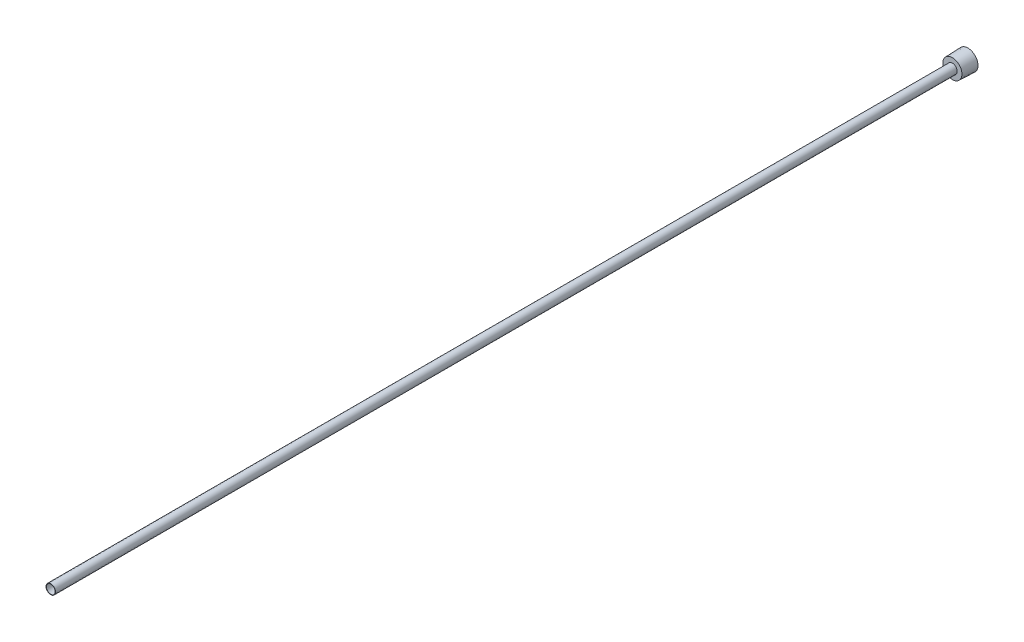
ISO-10303-21;
HEADER;
FILE_DESCRIPTION(('STEP AP214'),'2;1');
FILE_NAME('part.step','',(''),(''),'','','');
FILE_SCHEMA(('AUTOMOTIVE_DESIGN { 1 0 10303 214 1 1 1 1 }'));
ENDSEC;
DATA;
#1=APPLICATION_CONTEXT('core data for automotive mechanical design processes');
#2=APPLICATION_PROTOCOL_DEFINITION('international standard','automotive_design',2000,#1);
#3=PRODUCT_CONTEXT('',#1,'mechanical');
#4=PRODUCT('Part','Part','',(#3));
#5=PRODUCT_RELATED_PRODUCT_CATEGORY('part','',(#4));
#6=PRODUCT_DEFINITION_FORMATION('','',#4);
#7=PRODUCT_DEFINITION_CONTEXT('part definition',#1,'design');
#8=PRODUCT_DEFINITION('design','',#6,#7);
#9=PRODUCT_DEFINITION_SHAPE('','',#8);
#10=(LENGTH_UNIT() NAMED_UNIT(*) SI_UNIT(.MILLI.,.METRE.));
#11=(NAMED_UNIT(*) PLANE_ANGLE_UNIT() SI_UNIT($,.RADIAN.));
#12=(NAMED_UNIT(*) SI_UNIT($,.STERADIAN.) SOLID_ANGLE_UNIT());
#13=UNCERTAINTY_MEASURE_WITH_UNIT(LENGTH_MEASURE(1.E-05),#10,'distance_accuracy_value','');
#14=(GEOMETRIC_REPRESENTATION_CONTEXT(3) GLOBAL_UNCERTAINTY_ASSIGNED_CONTEXT((#13)) GLOBAL_UNIT_ASSIGNED_CONTEXT((#10,
#11,#12)) REPRESENTATION_CONTEXT('',''));
#15=CARTESIAN_POINT('',(0.,0.,0.));
#16=DIRECTION('',(0.,0.,1.));
#17=DIRECTION('',(1.,0.,0.));
#18=AXIS2_PLACEMENT_3D('',#15,#16,#17);
#19=CARTESIAN_POINT('',(0.,0.,0.));
#20=DIRECTION('',(0.,0.,1.));
#21=DIRECTION('',(1.,0.,0.));
#22=AXIS2_PLACEMENT_3D('',#19,#20,#21);
#23=CYLINDRICAL_SURFACE('',#22,2.921);
#24=CARTESIAN_POINT('',(0.,0.,609.6));
#25=DIRECTION('',(0.,0.,1.));
#26=DIRECTION('',(1.,0.,0.));
#27=AXIS2_PLACEMENT_3D('',#24,#25,#26);
#28=CIRCLE('',#27,2.921);
#29=CARTESIAN_POINT('',(2.921,0.,609.6));
#30=VERTEX_POINT('',#29);
#31=EDGE_CURVE('E142',#30,#30,#28,.T.);
#32=CARTESIAN_POINT('',(0.,0.,6.35));
#33=DIRECTION('',(0.,0.,-1.));
#34=DIRECTION('',(-1.,0.,0.));
#35=AXIS2_PLACEMENT_3D('',#32,#33,#34);
#36=CIRCLE('',#35,2.921);
#37=CARTESIAN_POINT('',(2.921,0.,6.35));
#38=VERTEX_POINT('',#37);
#39=EDGE_CURVE('E37',#38,#38,#36,.F.);
#40=CARTESIAN_POINT('',(2.921,0.,609.6));
#41=CARTESIAN_POINT('',(2.921,0.,603.316145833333));
#42=CARTESIAN_POINT('',(2.921,0.,597.032291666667));
#43=CARTESIAN_POINT('',(2.921,0.,584.464583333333));
#44=CARTESIAN_POINT('',(2.921,0.,578.180729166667));
#45=CARTESIAN_POINT('',(2.921,0.,565.613020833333));
#46=CARTESIAN_POINT('',(2.921,0.,559.329166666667));
#47=CARTESIAN_POINT('',(2.921,0.,546.761458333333));
#48=CARTESIAN_POINT('',(2.921,0.,540.477604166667));
#49=CARTESIAN_POINT('',(2.921,0.,527.909895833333));
#50=CARTESIAN_POINT('',(2.921,0.,521.626041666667));
#51=CARTESIAN_POINT('',(2.921,0.,509.058333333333));
#52=CARTESIAN_POINT('',(2.921,0.,502.774479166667));
#53=CARTESIAN_POINT('',(2.921,0.,490.206770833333));
#54=CARTESIAN_POINT('',(2.921,0.,483.922916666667));
#55=CARTESIAN_POINT('',(2.921,0.,471.355208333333));
#56=CARTESIAN_POINT('',(2.921,0.,465.071354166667));
#57=CARTESIAN_POINT('',(2.921,0.,452.503645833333));
#58=CARTESIAN_POINT('',(2.921,0.,446.219791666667));
#59=CARTESIAN_POINT('',(2.921,0.,433.652083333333));
#60=CARTESIAN_POINT('',(2.921,0.,427.368229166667));
#61=CARTESIAN_POINT('',(2.921,0.,414.800520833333));
#62=CARTESIAN_POINT('',(2.921,0.,408.516666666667));
#63=CARTESIAN_POINT('',(2.921,0.,395.948958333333));
#64=CARTESIAN_POINT('',(2.921,0.,389.665104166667));
#65=CARTESIAN_POINT('',(2.921,0.,377.097395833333));
#66=CARTESIAN_POINT('',(2.921,0.,370.813541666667));
#67=CARTESIAN_POINT('',(2.921,0.,358.245833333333));
#68=CARTESIAN_POINT('',(2.921,0.,351.961979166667));
#69=CARTESIAN_POINT('',(2.921,0.,339.394270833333));
#70=CARTESIAN_POINT('',(2.921,0.,333.110416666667));
#71=CARTESIAN_POINT('',(2.921,0.,320.542708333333));
#72=CARTESIAN_POINT('',(2.921,0.,314.258854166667));
#73=CARTESIAN_POINT('',(2.921,0.,301.691145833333));
#74=CARTESIAN_POINT('',(2.921,0.,295.407291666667));
#75=CARTESIAN_POINT('',(2.921,0.,282.839583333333));
#76=CARTESIAN_POINT('',(2.921,0.,276.555729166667));
#77=CARTESIAN_POINT('',(2.921,0.,263.988020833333));
#78=CARTESIAN_POINT('',(2.921,0.,257.704166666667));
#79=CARTESIAN_POINT('',(2.921,0.,245.136458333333));
#80=CARTESIAN_POINT('',(2.921,0.,238.852604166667));
#81=CARTESIAN_POINT('',(2.921,0.,226.284895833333));
#82=CARTESIAN_POINT('',(2.921,0.,220.001041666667));
#83=CARTESIAN_POINT('',(2.921,0.,207.433333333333));
#84=CARTESIAN_POINT('',(2.921,0.,201.149479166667));
#85=CARTESIAN_POINT('',(2.921,0.,188.581770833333));
#86=CARTESIAN_POINT('',(2.921,0.,182.297916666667));
#87=CARTESIAN_POINT('',(2.921,0.,169.730208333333));
#88=CARTESIAN_POINT('',(2.921,0.,163.446354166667));
#89=CARTESIAN_POINT('',(2.921,0.,150.878645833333));
#90=CARTESIAN_POINT('',(2.921,0.,144.594791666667));
#91=CARTESIAN_POINT('',(2.921,0.,132.027083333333));
#92=CARTESIAN_POINT('',(2.921,0.,125.743229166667));
#93=CARTESIAN_POINT('',(2.921,0.,113.175520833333));
#94=CARTESIAN_POINT('',(2.921,0.,106.891666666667));
#95=CARTESIAN_POINT('',(2.921,0.,94.3239583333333));
#96=CARTESIAN_POINT('',(2.921,0.,88.0401041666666));
#97=CARTESIAN_POINT('',(2.921,0.,75.4723958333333));
#98=CARTESIAN_POINT('',(2.921,0.,69.1885416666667));
#99=CARTESIAN_POINT('',(2.921,0.,56.6208333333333));
#100=CARTESIAN_POINT('',(2.921,0.,50.3369791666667));
#101=CARTESIAN_POINT('',(2.921,0.,37.7692708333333));
#102=CARTESIAN_POINT('',(2.921,0.,31.4854166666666));
#103=CARTESIAN_POINT('',(2.921,0.,18.9177083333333));
#104=CARTESIAN_POINT('',(2.921,0.,12.6338541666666));
#105=CARTESIAN_POINT('',(2.921,0.,6.34999999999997));
#106=B_SPLINE_CURVE_WITH_KNOTS('',3,(#40,#41,#42,#43,#44,#45,#46,#47,#48,#49,#50,#51,#52,#53,
#54,#55,#56,#57,#58,#59,#60,#61,#62,#63,#64,#65,#66,#67,#68,#69,#70,#71,#72,#73,#74,#75,#76,#77,
#78,#79,#80,#81,#82,#83,#84,#85,#86,#87,#88,#89,#90,#91,#92,#93,#94,#95,#96,#97,#98,#99,#100,
#101,#102,#103,#104,#105),.UNSPECIFIED.,.F.,.F.,(4,2,2,2,2,2,2,2,2,2,2,2,2,2,2,2,2,2,2,2,2,2,2,
2,2,2,2,2,2,2,2,2,4),(0.,18.8515625,37.7031250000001,56.5546875,75.40625,94.2578125,113.109375,
131.9609375,150.8125,169.6640625,188.515625,207.3671875,226.21875,245.0703125,263.921875,
282.7734375,301.625,320.4765625,339.328125,358.1796875,377.03125,395.8828125,414.734375,
433.5859375,452.4375,471.2890625,490.140625,508.9921875,527.84375,546.6953125,565.546875,
584.3984375,603.25),.UNSPECIFIED.);
#107=EDGE_CURVE('BSEAM33',#30,#38,#106,.T.);
#108=ORIENTED_EDGE('',*,*,#31,.T.);
#109=ORIENTED_EDGE('',*,*,#39,.F.);
#110=ORIENTED_EDGE('',*,*,#107,.T.);
#111=ORIENTED_EDGE('',*,*,#107,.F.);
#112=EDGE_LOOP('',(#108,#110,#109,#111));
#113=FACE_BOUND('',#112,.T.);
#114=ADVANCED_FACE('F33',(#113),#23,.F.);
#115=CARTESIAN_POINT('',(0.,0.,0.));
#116=DIRECTION('',(0.,0.,-1.));
#117=DIRECTION('',(-1.,0.,0.));
#118=AXIS2_PLACEMENT_3D('',#115,#116,#117);
#119=CONICAL_SURFACE('',#118,6.7183,0.0364599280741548);
#120=CARTESIAN_POINT('',(0.,0.,10.3124));
#121=DIRECTION('',(0.,0.,1.));
#122=DIRECTION('',(1.,0.,0.));
#123=AXIS2_PLACEMENT_3D('',#120,#121,#122);
#124=CIRCLE('',#123,6.34214394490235);
#125=CARTESIAN_POINT('',(6.34214394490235,0.,10.3124));
#126=VERTEX_POINT('',#125);
#127=EDGE_CURVE('E11',#126,#126,#124,.T.);
#128=ORIENTED_EDGE('',*,*,#127,.F.);
#129=EDGE_LOOP('',(#128));
#130=FACE_BOUND('',#129,.T.);
#131=CARTESIAN_POINT('',(0.,0.,0.));
#132=DIRECTION('',(0.,0.,1.));
#133=DIRECTION('',(1.,0.,0.));
#134=AXIS2_PLACEMENT_3D('',#131,#132,#133);
#135=CIRCLE('',#134,6.7183);
#136=CARTESIAN_POINT('',(6.7183,0.,0.));
#137=VERTEX_POINT('',#136);
#138=EDGE_CURVE('E145',#137,#137,#135,.T.);
#139=ORIENTED_EDGE('',*,*,#138,.T.);
#140=EDGE_LOOP('',(#139));
#141=FACE_BOUND('',#140,.T.);
#142=ADVANCED_FACE('F35',(#130,#141),#119,.T.);
#143=CARTESIAN_POINT('',(0.,6.34214394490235,10.3124));
#144=DIRECTION('',(0.,0.,-1.));
#145=DIRECTION('',(-1.,0.,0.));
#146=AXIS2_PLACEMENT_3D('',#143,#144,#145);
#147=PLANE('',#146);
#148=CARTESIAN_POINT('',(0.,0.,10.3124));
#149=DIRECTION('',(0.,0.,1.));
#150=DIRECTION('',(1.,0.,0.));
#151=AXIS2_PLACEMENT_3D('',#148,#149,#150);
#152=CIRCLE('',#151,3.175);
#153=CARTESIAN_POINT('',(3.175,0.,10.3124));
#154=VERTEX_POINT('',#153);
#155=EDGE_CURVE('E42',#154,#154,#152,.T.);
#156=ORIENTED_EDGE('',*,*,#155,.F.);
#157=EDGE_LOOP('',(#156));
#158=FACE_BOUND('',#157,.T.);
#159=ORIENTED_EDGE('',*,*,#127,.T.);
#160=EDGE_LOOP('',(#159));
#161=FACE_BOUND('',#160,.T.);
#162=ADVANCED_FACE('F156',(#158,#161),#147,.F.);
#163=CARTESIAN_POINT('',(0.,0.,331.124179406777));
#164=DIRECTION('',(0.,0.,1.));
#165=DIRECTION('',(1.,0.,0.));
#166=AXIS2_PLACEMENT_3D('',#163,#164,#165);
#167=CYLINDRICAL_SURFACE('',#166,3.17499999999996);
#168=CARTESIAN_POINT('',(0.,0.,609.6));
#169=DIRECTION('',(0.,0.,1.));
#170=DIRECTION('',(1.,0.,0.));
#171=AXIS2_PLACEMENT_3D('',#168,#169,#170);
#172=CIRCLE('',#171,3.17499999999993);
#173=CARTESIAN_POINT('',(3.17499999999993,0.,609.6));
#174=VERTEX_POINT('',#173);
#175=EDGE_CURVE('E148',#174,#174,#172,.T.);
#176=ORIENTED_EDGE('',*,*,#175,.F.);
#177=EDGE_LOOP('',(#176));
#178=FACE_BOUND('',#177,.T.);
#179=ORIENTED_EDGE('',*,*,#155,.T.);
#180=EDGE_LOOP('',(#179));
#181=FACE_BOUND('',#180,.T.);
#182=ADVANCED_FACE('F154',(#178,#181),#167,.T.);
#183=CARTESIAN_POINT('',(0.,3.17499999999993,609.6));
#184=DIRECTION('',(0.,0.,-1.));
#185=DIRECTION('',(-1.,0.,0.));
#186=AXIS2_PLACEMENT_3D('',#183,#184,#185);
#187=PLANE('',#186);
#188=ORIENTED_EDGE('',*,*,#31,.F.);
#189=EDGE_LOOP('',(#188));
#190=FACE_BOUND('',#189,.T.);
#191=ORIENTED_EDGE('',*,*,#175,.T.);
#192=EDGE_LOOP('',(#191));
#193=FACE_BOUND('',#192,.T.);
#194=ADVANCED_FACE('F167',(#190,#193),#187,.F.);
#195=CARTESIAN_POINT('',(0.,0.,0.));
#196=DIRECTION('',(0.,0.,1.));
#197=DIRECTION('',(1.,0.,0.));
#198=AXIS2_PLACEMENT_3D('',#195,#196,#197);
#199=PLANE('',#198);
#200=DIRECTION('',(-0.866025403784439,0.5,0.));
#201=VECTOR('',#200,1.);
#202=CARTESIAN_POINT('',(0.,-3.66617420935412,0.));
#203=LINE('',#202,#201);
#204=CARTESIAN_POINT('',(0.,-3.66617420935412,0.));
#205=VERTEX_POINT('',#204);
#206=CARTESIAN_POINT('',(-3.175,-1.83308710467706,0.));
#207=VERTEX_POINT('',#206);
#208=EDGE_CURVE('E124',#205,#207,#203,.T.);
#209=ORIENTED_EDGE('',*,*,#208,.F.);
#210=DIRECTION('',(-0.866025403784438,-0.5,0.));
#211=VECTOR('',#210,1.);
#212=CARTESIAN_POINT('',(3.175,-1.83308710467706,0.));
#213=LINE('',#212,#211);
#214=CARTESIAN_POINT('',(3.175,-1.83308710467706,0.));
#215=VERTEX_POINT('',#214);
#216=EDGE_CURVE('E49',#215,#205,#213,.T.);
#217=ORIENTED_EDGE('',*,*,#216,.F.);
#218=DIRECTION('',(0.,-1.,0.));
#219=VECTOR('',#218,1.);
#220=CARTESIAN_POINT('',(3.175,1.83308710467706,0.));
#221=LINE('',#220,#219);
#222=CARTESIAN_POINT('',(3.175,1.83308710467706,0.));
#223=VERTEX_POINT('',#222);
#224=EDGE_CURVE('E133',#223,#215,#221,.T.);
#225=ORIENTED_EDGE('',*,*,#224,.F.);
#226=DIRECTION('',(0.866025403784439,-0.5,0.));
#227=VECTOR('',#226,1.);
#228=CARTESIAN_POINT('',(0.,3.66617420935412,0.));
#229=LINE('',#228,#227);
#230=CARTESIAN_POINT('',(0.,3.66617420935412,0.));
#231=VERTEX_POINT('',#230);
#232=EDGE_CURVE('E131',#231,#223,#229,.T.);
#233=ORIENTED_EDGE('',*,*,#232,.F.);
#234=DIRECTION('',(0.866025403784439,0.5,0.));
#235=VECTOR('',#234,1.);
#236=CARTESIAN_POINT('',(-3.175,1.83308710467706,0.));
#237=LINE('',#236,#235);
#238=CARTESIAN_POINT('',(-3.175,1.83308710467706,0.));
#239=VERTEX_POINT('',#238);
#240=EDGE_CURVE('E97',#239,#231,#237,.T.);
#241=ORIENTED_EDGE('',*,*,#240,.F.);
#242=DIRECTION('',(0.,1.,0.));
#243=VECTOR('',#242,1.);
#244=CARTESIAN_POINT('',(-3.175,-1.83308710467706,0.));
#245=LINE('',#244,#243);
#246=EDGE_CURVE('E127',#207,#239,#245,.T.);
#247=ORIENTED_EDGE('',*,*,#246,.F.);
#248=EDGE_LOOP('',(#209,#217,#225,#233,#241,#247));
#249=FACE_BOUND('',#248,.T.);
#250=ORIENTED_EDGE('',*,*,#138,.F.);
#251=EDGE_LOOP('',(#250));
#252=FACE_BOUND('',#251,.T.);
#253=ADVANCED_FACE('F165',(#249,#252),#199,.F.);
#254=CARTESIAN_POINT('',(0.,-3.66617420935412,6.35));
#255=DIRECTION('',(0.,0.,-1.));
#256=DIRECTION('',(-1.,0.,0.));
#257=AXIS2_PLACEMENT_3D('',#254,#255,#256);
#258=PLANE('',#257);
#259=DIRECTION('',(-0.866025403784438,-0.5,0.));
#260=VECTOR('',#259,1.);
#261=CARTESIAN_POINT('',(3.175,-1.83308710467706,6.35));
#262=LINE('',#261,#260);
#263=CARTESIAN_POINT('',(3.175,-1.83308710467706,6.35));
#264=VERTEX_POINT('',#263);
#265=CARTESIAN_POINT('',(0.,-3.66617420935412,6.35));
#266=VERTEX_POINT('',#265);
#267=EDGE_CURVE('E135',#264,#266,#262,.T.);
#268=ORIENTED_EDGE('',*,*,#267,.T.);
#269=DIRECTION('',(-0.866025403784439,0.5,0.));
#270=VECTOR('',#269,1.);
#271=CARTESIAN_POINT('',(0.,-3.66617420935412,6.35));
#272=LINE('',#271,#270);
#273=CARTESIAN_POINT('',(-3.175,-1.83308710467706,6.35));
#274=VERTEX_POINT('',#273);
#275=EDGE_CURVE('E118',#266,#274,#272,.T.);
#276=ORIENTED_EDGE('',*,*,#275,.T.);
#277=DIRECTION('',(0.,1.,0.));
#278=VECTOR('',#277,1.);
#279=CARTESIAN_POINT('',(-3.175,-1.83308710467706,6.35));
#280=LINE('',#279,#278);
#281=CARTESIAN_POINT('',(-3.175,1.83308710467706,6.35));
#282=VERTEX_POINT('',#281);
#283=EDGE_CURVE('E116',#274,#282,#280,.T.);
#284=ORIENTED_EDGE('',*,*,#283,.T.);
#285=DIRECTION('',(0.866025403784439,0.5,0.));
#286=VECTOR('',#285,1.);
#287=CARTESIAN_POINT('',(-3.175,1.83308710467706,6.35));
#288=LINE('',#287,#286);
#289=CARTESIAN_POINT('',(0.,3.66617420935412,6.35));
#290=VERTEX_POINT('',#289);
#291=EDGE_CURVE('E94',#282,#290,#288,.T.);
#292=ORIENTED_EDGE('',*,*,#291,.T.);
#293=DIRECTION('',(0.866025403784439,-0.5,0.));
#294=VECTOR('',#293,1.);
#295=CARTESIAN_POINT('',(0.,3.66617420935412,6.35));
#296=LINE('',#295,#294);
#297=CARTESIAN_POINT('',(3.175,1.83308710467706,6.35));
#298=VERTEX_POINT('',#297);
#299=EDGE_CURVE('E105',#290,#298,#296,.T.);
#300=ORIENTED_EDGE('',*,*,#299,.T.);
#301=DIRECTION('',(0.,-1.,0.));
#302=VECTOR('',#301,1.);
#303=CARTESIAN_POINT('',(3.175,1.83308710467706,6.35));
#304=LINE('',#303,#302);
#305=EDGE_CURVE('E109',#298,#264,#304,.T.);
#306=ORIENTED_EDGE('',*,*,#305,.T.);
#307=EDGE_LOOP('',(#268,#276,#284,#292,#300,#306));
#308=FACE_BOUND('',#307,.T.);
#309=ORIENTED_EDGE('',*,*,#39,.T.);
#310=EDGE_LOOP('',(#309));
#311=FACE_BOUND('',#310,.T.);
#312=ADVANCED_FACE('F112',(#308,#311),#258,.T.);
#313=CARTESIAN_POINT('',(3.175,-1.83308710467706,6.35));
#314=DIRECTION('',(0.5,-0.866025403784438,0.));
#315=DIRECTION('',(0.866025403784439,0.5,0.));
#316=AXIS2_PLACEMENT_3D('',#313,#314,#315);
#317=PLANE('',#316);
#318=ORIENTED_EDGE('',*,*,#216,.T.);
#319=DIRECTION('',(0.,0.,-1.));
#320=VECTOR('',#319,1.);
#321=CARTESIAN_POINT('',(0.,-3.66617420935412,6.35));
#322=LINE('',#321,#320);
#323=EDGE_CURVE('E79',#266,#205,#322,.T.);
#324=ORIENTED_EDGE('',*,*,#323,.F.);
#325=ORIENTED_EDGE('',*,*,#267,.F.);
#326=DIRECTION('',(0.,0.,-1.));
#327=VECTOR('',#326,1.);
#328=CARTESIAN_POINT('',(3.175,-1.83308710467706,6.35));
#329=LINE('',#328,#327);
#330=EDGE_CURVE('E57',#264,#215,#329,.T.);
#331=ORIENTED_EDGE('',*,*,#330,.T.);
#332=EDGE_LOOP('',(#318,#324,#325,#331));
#333=FACE_BOUND('',#332,.T.);
#334=ADVANCED_FACE('F174',(#333),#317,.F.);
#335=CARTESIAN_POINT('',(3.175,1.83308710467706,6.35));
#336=DIRECTION('',(1.,0.,0.));
#337=DIRECTION('',(0.,1.,0.));
#338=AXIS2_PLACEMENT_3D('',#335,#336,#337);
#339=PLANE('',#338);
#340=ORIENTED_EDGE('',*,*,#224,.T.);
#341=ORIENTED_EDGE('',*,*,#330,.F.);
#342=ORIENTED_EDGE('',*,*,#305,.F.);
#343=DIRECTION('',(0.,0.,-1.));
#344=VECTOR('',#343,1.);
#345=CARTESIAN_POINT('',(3.175,1.83308710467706,6.35));
#346=LINE('',#345,#344);
#347=EDGE_CURVE('E101',#298,#223,#346,.T.);
#348=ORIENTED_EDGE('',*,*,#347,.T.);
#349=EDGE_LOOP('',(#340,#341,#342,#348));
#350=FACE_BOUND('',#349,.T.);
#351=ADVANCED_FACE('F188',(#350),#339,.F.);
#352=CARTESIAN_POINT('',(0.,3.66617420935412,6.35));
#353=DIRECTION('',(0.5,0.866025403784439,0.));
#354=DIRECTION('',(-0.866025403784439,0.5,0.));
#355=AXIS2_PLACEMENT_3D('',#352,#353,#354);
#356=PLANE('',#355);
#357=ORIENTED_EDGE('',*,*,#232,.T.);
#358=ORIENTED_EDGE('',*,*,#347,.F.);
#359=ORIENTED_EDGE('',*,*,#299,.F.);
#360=DIRECTION('',(0.,0.,-1.));
#361=VECTOR('',#360,1.);
#362=CARTESIAN_POINT('',(0.,3.66617420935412,6.35));
#363=LINE('',#362,#361);
#364=EDGE_CURVE('E90',#290,#231,#363,.T.);
#365=ORIENTED_EDGE('',*,*,#364,.T.);
#366=EDGE_LOOP('',(#357,#358,#359,#365));
#367=FACE_BOUND('',#366,.T.);
#368=ADVANCED_FACE('F106',(#367),#356,.F.);
#369=CARTESIAN_POINT('',(-3.175,1.83308710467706,6.35));
#370=DIRECTION('',(-0.5,0.866025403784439,0.));
#371=DIRECTION('',(-0.866025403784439,-0.5,0.));
#372=AXIS2_PLACEMENT_3D('',#369,#370,#371);
#373=PLANE('',#372);
#374=ORIENTED_EDGE('',*,*,#240,.T.);
#375=ORIENTED_EDGE('',*,*,#364,.F.);
#376=ORIENTED_EDGE('',*,*,#291,.F.);
#377=DIRECTION('',(0.,0.,-1.));
#378=VECTOR('',#377,1.);
#379=CARTESIAN_POINT('',(-3.175,1.83308710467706,6.35));
#380=LINE('',#379,#378);
#381=EDGE_CURVE('E102',#282,#239,#380,.T.);
#382=ORIENTED_EDGE('',*,*,#381,.T.);
#383=EDGE_LOOP('',(#374,#375,#376,#382));
#384=FACE_BOUND('',#383,.T.);
#385=ADVANCED_FACE('F92',(#384),#373,.F.);
#386=CARTESIAN_POINT('',(-3.175,-1.83308710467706,6.35));
#387=DIRECTION('',(-1.,0.,0.));
#388=DIRECTION('',(0.,-1.,0.));
#389=AXIS2_PLACEMENT_3D('',#386,#387,#388);
#390=PLANE('',#389);
#391=ORIENTED_EDGE('',*,*,#246,.T.);
#392=ORIENTED_EDGE('',*,*,#381,.F.);
#393=ORIENTED_EDGE('',*,*,#283,.F.);
#394=DIRECTION('',(0.,0.,-1.));
#395=VECTOR('',#394,1.);
#396=CARTESIAN_POINT('',(-3.175,-1.83308710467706,6.35));
#397=LINE('',#396,#395);
#398=EDGE_CURVE('E139',#274,#207,#397,.T.);
#399=ORIENTED_EDGE('',*,*,#398,.T.);
#400=EDGE_LOOP('',(#391,#392,#393,#399));
#401=FACE_BOUND('',#400,.T.);
#402=ADVANCED_FACE('F192',(#401),#390,.F.);
#403=CARTESIAN_POINT('',(0.,-3.66617420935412,6.35));
#404=DIRECTION('',(-0.5,-0.866025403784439,0.));
#405=DIRECTION('',(0.866025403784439,-0.5,0.));
#406=AXIS2_PLACEMENT_3D('',#403,#404,#405);
#407=PLANE('',#406);
#408=ORIENTED_EDGE('',*,*,#208,.T.);
#409=ORIENTED_EDGE('',*,*,#398,.F.);
#410=ORIENTED_EDGE('',*,*,#275,.F.);
#411=ORIENTED_EDGE('',*,*,#323,.T.);
#412=EDGE_LOOP('',(#408,#409,#410,#411));
#413=FACE_BOUND('',#412,.T.);
#414=ADVANCED_FACE('F189',(#413),#407,.F.);
#415=CLOSED_SHELL('',(#114,#142,#162,#182,#194,#253,#312,#334,#351,#368,#385,#402,#414));
#416=MANIFOLD_SOLID_BREP('B2',#415);
#417=ADVANCED_BREP_SHAPE_REPRESENTATION('',(#18,#416),#14);
#418=SHAPE_DEFINITION_REPRESENTATION(#9,#417);
ENDSEC;
END-ISO-10303-21;
